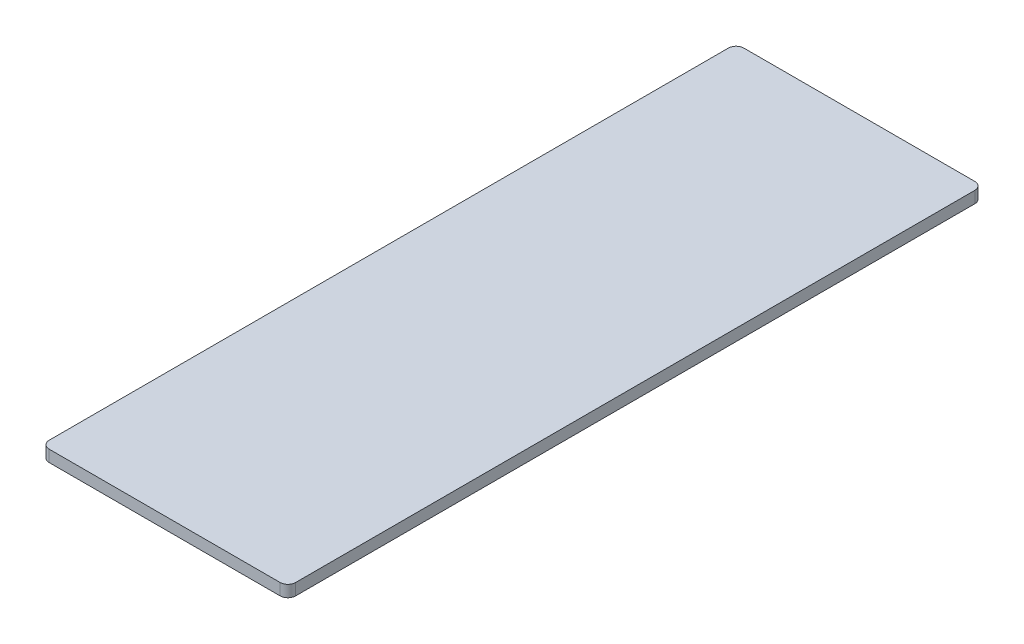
from build123d import *

# Parameters (mm, degrees)
ESQUISSE1_W        = 63.5
ESQUISSE1_H        = 3
BOSS_EXTRU_1_DEPTH = 179
CONG_1_R           = 2


with BuildPart() as part:
    # Esquisse1 → Boss.-Extru.1 (new body)
    with BuildSketch(Plane.XY):
        with Locations((-35.084999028, 52.278715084)):
            Rectangle(ESQUISSE1_W, ESQUISSE1_H)
    extrude(amount=BOSS_EXTRU_1_DEPTH)

    # Cong_1
    cong_1_edges = [part.edges().sort_by_distance(p)[0] for p in [
        (-3.334999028, 52.278715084, 179),
        (-66.834999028, 52.278715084, 179),
        (-3.334999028, 52.278715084, 0),
        (-66.834999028, 52.278715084, 0),
    ]]
    fillet(cong_1_edges, radius=CONG_1_R)


solid = part.part
